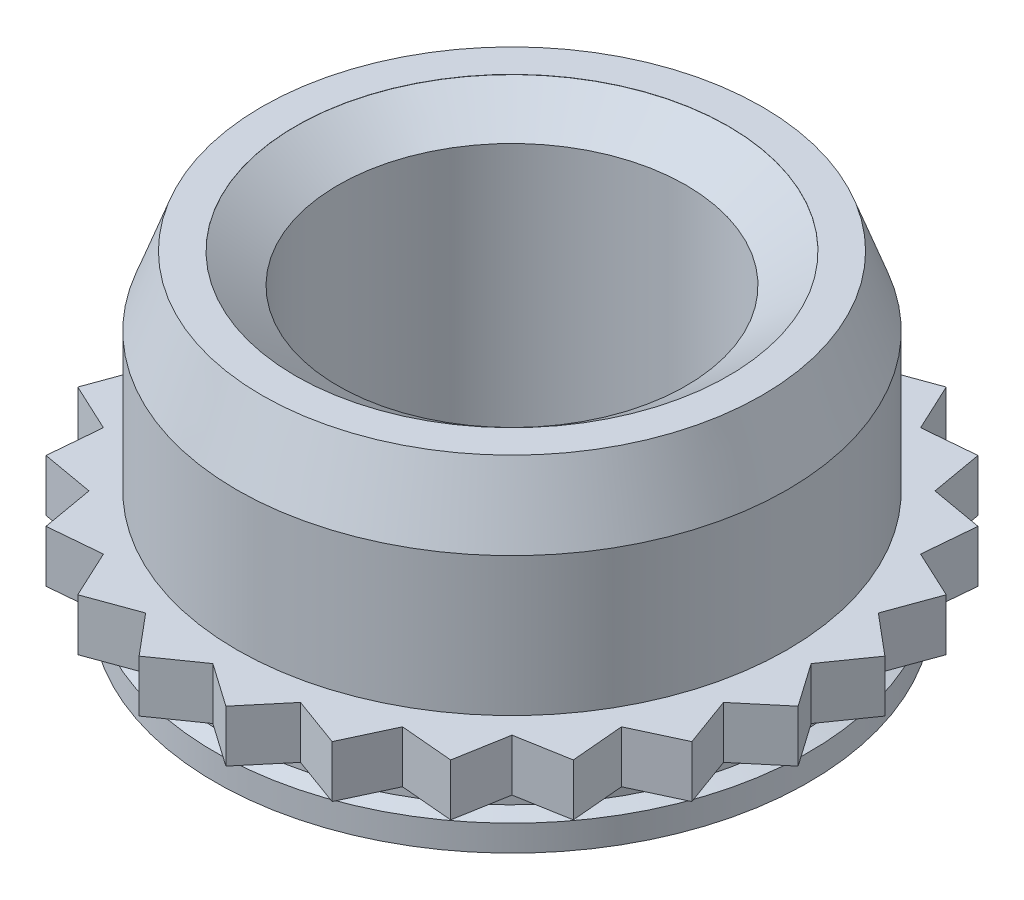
from build123d import *

# Parameters (mm, degrees)
CLINCHCUT_START    = -0.762
CLINCHCUT_DEPTH    = 0.762
CLINCHCUTPAT_COUNT = 24
CLINCHCUTPAT_ANGLE = 345


with BuildPart() as part:
    # BodySke → Body (revolve)
    with BuildSketch(Plane.XY, mode=Mode.PRIVATE) as body_sk:
        Polygon((4.138295, -1.063725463), (4.138295, -0.762), (4.8768, -0.762), (4.8768, 0), (4.0386, 0), (4.0386, 2.032), (3.668806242, 3.048), (2.5527, 3.048), (2.5527, -1.524), (4.3561, -1.524), (4.3561, -1.143), align=None)
    revolve(body_sk.sketch.rotate(Axis((0, -1.143, 0), (0, 1, 0)), 90), axis=Axis((0, -1.143, 0), (0, 1, 0)))

    # EndChamferSke → EndChamfer (revolve, cut)
    with BuildSketch(Plane.XY, mode=Mode.PRIVATE) as endchamfer_sk:
        Polygon((3.175, -1.778), (3.175, -1.52146), (2.5527, -1.085882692), (2.5527, -1.778), align=None)
        Polygon((3.175, 3.04546), (3.175, 3.302), (2.5527, 3.302), (2.5527, 2.609882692), align=None)
    revolve(endchamfer_sk.sketch.rotate(Axis((0, -2.54, 0), (0, 1, 0)), 90), axis=Axis((0, -2.54, 0), (0, 1, 0)), mode=Mode.SUBTRACT)

    # CliRinCutSke → ClinchCut (cut)
    with BuildSketch(Plane.XZ.offset(0.762).offset(CLINCHCUT_START)):
        with BuildLine():
            Line((0.636550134, 4.8350783), (0, 4.38912))
            Line((0, 4.38912), (-0.636550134, 4.8350783))
            ThreePointArc((-0.636550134, 4.8350783), (0, 4.8768), (0.636550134, 4.8350783))
        make_face()
    clinchcut = extrude(amount=CLINCHCUT_DEPTH, mode=Mode.SUBTRACT)

    # ClinchCutPat: ClinchCut ×24 about axis
    clinchcutpat_axis = Axis((0, 0, 0), (0, 1, 0))
    for i in range(1, CLINCHCUTPAT_COUNT):
        add(clinchcut.rotate(clinchcutpat_axis, i * CLINCHCUTPAT_ANGLE / (CLINCHCUTPAT_COUNT - 1)), mode=Mode.SUBTRACT)


solid = part.part
